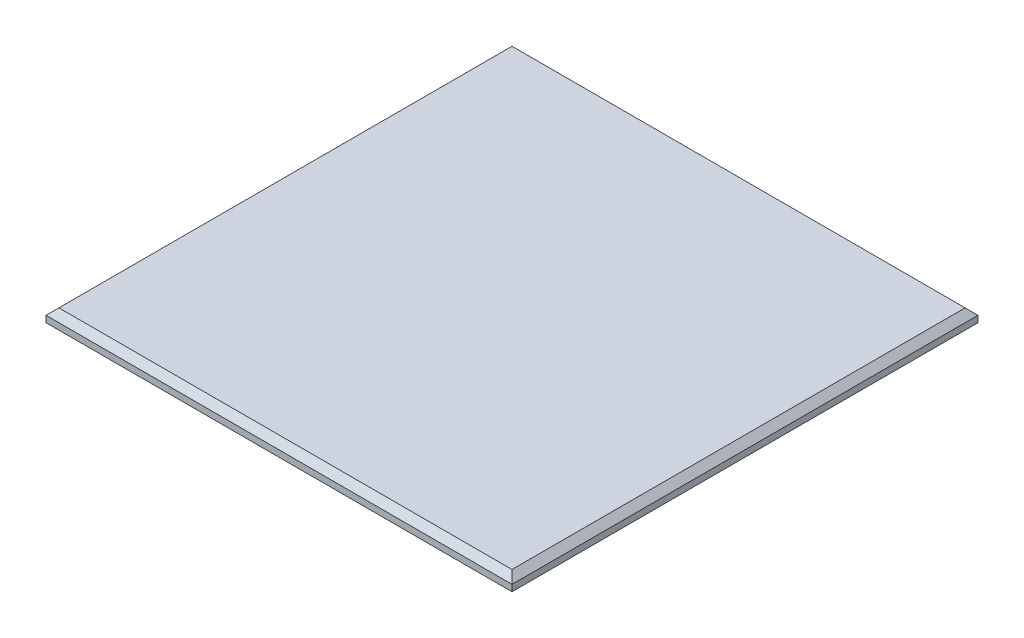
ISO-10303-21;
HEADER;
FILE_DESCRIPTION(('STEP AP214'),'2;1');
FILE_NAME('part.step','',(''),(''),'','','');
FILE_SCHEMA(('AUTOMOTIVE_DESIGN { 1 0 10303 214 1 1 1 1 }'));
ENDSEC;
DATA;
#1=APPLICATION_CONTEXT('core data for automotive mechanical design processes');
#2=APPLICATION_PROTOCOL_DEFINITION('international standard','automotive_design',2000,#1);
#3=PRODUCT_CONTEXT('',#1,'mechanical');
#4=PRODUCT('Part','Part','',(#3));
#5=PRODUCT_RELATED_PRODUCT_CATEGORY('part','',(#4));
#6=PRODUCT_DEFINITION_FORMATION('','',#4);
#7=PRODUCT_DEFINITION_CONTEXT('part definition',#1,'design');
#8=PRODUCT_DEFINITION('design','',#6,#7);
#9=PRODUCT_DEFINITION_SHAPE('','',#8);
#10=(LENGTH_UNIT() NAMED_UNIT(*) SI_UNIT(.MILLI.,.METRE.));
#11=(NAMED_UNIT(*) PLANE_ANGLE_UNIT() SI_UNIT($,.RADIAN.));
#12=(NAMED_UNIT(*) SI_UNIT($,.STERADIAN.) SOLID_ANGLE_UNIT());
#13=UNCERTAINTY_MEASURE_WITH_UNIT(LENGTH_MEASURE(1.E-05),#10,'distance_accuracy_value','');
#14=(GEOMETRIC_REPRESENTATION_CONTEXT(3) GLOBAL_UNCERTAINTY_ASSIGNED_CONTEXT((#13)) GLOBAL_UNIT_ASSIGNED_CONTEXT((#10,
#11,#12)) REPRESENTATION_CONTEXT('',''));
#15=CARTESIAN_POINT('',(0.,0.,0.));
#16=DIRECTION('',(0.,0.,1.));
#17=DIRECTION('',(1.,0.,0.));
#18=AXIS2_PLACEMENT_3D('',#15,#16,#17);
#19=CARTESIAN_POINT('',(-230.,12.7,-230.));
#20=DIRECTION('',(1.,0.,0.));
#21=DIRECTION('',(0.,0.,-1.));
#22=AXIS2_PLACEMENT_3D('',#19,#20,#21);
#23=PLANE('',#22);
#24=DIRECTION('',(0.,-1.,0.));
#25=VECTOR('',#24,1.);
#26=CARTESIAN_POINT('',(-230.,12.7,230.));
#27=LINE('',#26,#25);
#28=CARTESIAN_POINT('',(-230.,6.34999999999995,230.));
#29=VERTEX_POINT('',#28);
#30=CARTESIAN_POINT('',(-230.,0.,230.));
#31=VERTEX_POINT('',#30);
#32=EDGE_CURVE('E87',#29,#31,#27,.T.);
#33=ORIENTED_EDGE('',*,*,#32,.F.);
#34=DIRECTION('',(0.,0.,-1.));
#35=VECTOR('',#34,1.);
#36=CARTESIAN_POINT('',(-230.,6.34999999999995,-230.));
#37=LINE('',#36,#35);
#38=CARTESIAN_POINT('',(-230.,6.34999999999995,-230.));
#39=VERTEX_POINT('',#38);
#40=EDGE_CURVE('E11',#29,#39,#37,.T.);
#41=ORIENTED_EDGE('',*,*,#40,.T.);
#42=DIRECTION('',(0.,-1.,0.));
#43=VECTOR('',#42,1.);
#44=CARTESIAN_POINT('',(-230.,12.7,-230.));
#45=LINE('',#44,#43);
#46=CARTESIAN_POINT('',(-230.,0.,-230.));
#47=VERTEX_POINT('',#46);
#48=EDGE_CURVE('E107',#39,#47,#45,.T.);
#49=ORIENTED_EDGE('',*,*,#48,.T.);
#50=DIRECTION('',(0.,0.,1.));
#51=VECTOR('',#50,1.);
#52=CARTESIAN_POINT('',(-230.,0.,-230.));
#53=LINE('',#52,#51);
#54=EDGE_CURVE('E103',#47,#31,#53,.T.);
#55=ORIENTED_EDGE('',*,*,#54,.T.);
#56=EDGE_LOOP('',(#33,#41,#49,#55));
#57=FACE_BOUND('',#56,.T.);
#58=ADVANCED_FACE('F34',(#57),#23,.F.);
#59=CARTESIAN_POINT('',(-230.,12.7,230.));
#60=DIRECTION('',(0.,0.,-1.));
#61=DIRECTION('',(-1.,0.,0.));
#62=AXIS2_PLACEMENT_3D('',#59,#60,#61);
#63=PLANE('',#62);
#64=DIRECTION('',(0.,-1.,0.));
#65=VECTOR('',#64,1.);
#66=CARTESIAN_POINT('',(230.,12.7,230.));
#67=LINE('',#66,#65);
#68=CARTESIAN_POINT('',(230.,6.34999999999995,230.));
#69=VERTEX_POINT('',#68);
#70=CARTESIAN_POINT('',(230.,0.,230.));
#71=VERTEX_POINT('',#70);
#72=EDGE_CURVE('E97',#69,#71,#67,.T.);
#73=ORIENTED_EDGE('',*,*,#72,.F.);
#74=DIRECTION('',(-1.,0.,0.));
#75=VECTOR('',#74,1.);
#76=CARTESIAN_POINT('',(-230.,6.34999999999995,230.));
#77=LINE('',#76,#75);
#78=EDGE_CURVE('E94',#69,#29,#77,.T.);
#79=ORIENTED_EDGE('',*,*,#78,.T.);
#80=ORIENTED_EDGE('',*,*,#32,.T.);
#81=DIRECTION('',(1.,0.,0.));
#82=VECTOR('',#81,1.);
#83=CARTESIAN_POINT('',(-230.,0.,230.));
#84=LINE('',#83,#82);
#85=EDGE_CURVE('E91',#31,#71,#84,.T.);
#86=ORIENTED_EDGE('',*,*,#85,.T.);
#87=EDGE_LOOP('',(#73,#79,#80,#86));
#88=FACE_BOUND('',#87,.T.);
#89=ADVANCED_FACE('F90',(#88),#63,.F.);
#90=CARTESIAN_POINT('',(230.,12.7,-230.));
#91=DIRECTION('',(-1.,0.,0.));
#92=DIRECTION('',(0.,0.,1.));
#93=AXIS2_PLACEMENT_3D('',#90,#91,#92);
#94=PLANE('',#93);
#95=DIRECTION('',(0.,-1.,0.));
#96=VECTOR('',#95,1.);
#97=CARTESIAN_POINT('',(230.,12.7,-230.));
#98=LINE('',#97,#96);
#99=CARTESIAN_POINT('',(230.,6.34999999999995,-230.));
#100=VERTEX_POINT('',#99);
#101=CARTESIAN_POINT('',(230.,0.,-230.));
#102=VERTEX_POINT('',#101);
#103=EDGE_CURVE('E117',#100,#102,#98,.T.);
#104=ORIENTED_EDGE('',*,*,#103,.F.);
#105=DIRECTION('',(0.,0.,1.));
#106=VECTOR('',#105,1.);
#107=CARTESIAN_POINT('',(230.,6.34999999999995,230.));
#108=LINE('',#107,#106);
#109=EDGE_CURVE('E129',#100,#69,#108,.T.);
#110=ORIENTED_EDGE('',*,*,#109,.T.);
#111=ORIENTED_EDGE('',*,*,#72,.T.);
#112=DIRECTION('',(0.,0.,-1.));
#113=VECTOR('',#112,1.);
#114=CARTESIAN_POINT('',(230.,0.,-230.));
#115=LINE('',#114,#113);
#116=EDGE_CURVE('E105',#71,#102,#115,.T.);
#117=ORIENTED_EDGE('',*,*,#116,.T.);
#118=EDGE_LOOP('',(#104,#110,#111,#117));
#119=FACE_BOUND('',#118,.T.);
#120=ADVANCED_FACE('F165',(#119),#94,.F.);
#121=CARTESIAN_POINT('',(-230.,12.7,-230.));
#122=DIRECTION('',(0.,0.,1.));
#123=DIRECTION('',(1.,0.,0.));
#124=AXIS2_PLACEMENT_3D('',#121,#122,#123);
#125=PLANE('',#124);
#126=ORIENTED_EDGE('',*,*,#48,.F.);
#127=DIRECTION('',(1.,0.,0.));
#128=VECTOR('',#127,1.);
#129=CARTESIAN_POINT('',(230.,6.34999999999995,-230.));
#130=LINE('',#129,#128);
#131=EDGE_CURVE('E43',#39,#100,#130,.T.);
#132=ORIENTED_EDGE('',*,*,#131,.T.);
#133=ORIENTED_EDGE('',*,*,#103,.T.);
#134=DIRECTION('',(-1.,0.,0.));
#135=VECTOR('',#134,1.);
#136=CARTESIAN_POINT('',(-230.,0.,-230.));
#137=LINE('',#136,#135);
#138=EDGE_CURVE('E114',#102,#47,#137,.T.);
#139=ORIENTED_EDGE('',*,*,#138,.T.);
#140=EDGE_LOOP('',(#126,#132,#133,#139));
#141=FACE_BOUND('',#140,.T.);
#142=ADVANCED_FACE('F198',(#141),#125,.F.);
#143=CARTESIAN_POINT('',(-230.,12.7,230.));
#144=DIRECTION('',(0.,1.,0.));
#145=DIRECTION('',(0.,0.,1.));
#146=AXIS2_PLACEMENT_3D('',#143,#144,#145);
#147=PLANE('',#146);
#148=DIRECTION('',(0.,0.,1.));
#149=VECTOR('',#148,1.);
#150=CARTESIAN_POINT('',(-223.65,12.7,230.));
#151=LINE('',#150,#149);
#152=CARTESIAN_POINT('',(-223.65,12.7,-223.65));
#153=VERTEX_POINT('',#152);
#154=CARTESIAN_POINT('',(-223.65,12.7,223.65));
#155=VERTEX_POINT('',#154);
#156=EDGE_CURVE('E96',#153,#155,#151,.T.);
#157=ORIENTED_EDGE('',*,*,#156,.T.);
#158=DIRECTION('',(1.,0.,0.));
#159=VECTOR('',#158,1.);
#160=CARTESIAN_POINT('',(230.,12.7,223.65));
#161=LINE('',#160,#159);
#162=CARTESIAN_POINT('',(223.65,12.7,223.65));
#163=VERTEX_POINT('',#162);
#164=EDGE_CURVE('E125',#155,#163,#161,.T.);
#165=ORIENTED_EDGE('',*,*,#164,.T.);
#166=DIRECTION('',(0.,0.,-1.));
#167=VECTOR('',#166,1.);
#168=CARTESIAN_POINT('',(223.65,12.7,-230.));
#169=LINE('',#168,#167);
#170=CARTESIAN_POINT('',(223.65,12.7,-223.65));
#171=VERTEX_POINT('',#170);
#172=EDGE_CURVE('E123',#163,#171,#169,.T.);
#173=ORIENTED_EDGE('',*,*,#172,.T.);
#174=DIRECTION('',(-1.,0.,0.));
#175=VECTOR('',#174,1.);
#176=CARTESIAN_POINT('',(-230.,12.7,-223.65));
#177=LINE('',#176,#175);
#178=EDGE_CURVE('E121',#171,#153,#177,.T.);
#179=ORIENTED_EDGE('',*,*,#178,.T.);
#180=EDGE_LOOP('',(#157,#165,#173,#179));
#181=FACE_BOUND('',#180,.T.);
#182=ADVANCED_FACE('F147',(#181),#147,.T.);
#183=CARTESIAN_POINT('',(-230.,0.,230.));
#184=DIRECTION('',(0.,1.,0.));
#185=DIRECTION('',(0.,0.,1.));
#186=AXIS2_PLACEMENT_3D('',#183,#184,#185);
#187=PLANE('',#186);
#188=ORIENTED_EDGE('',*,*,#54,.F.);
#189=ORIENTED_EDGE('',*,*,#138,.F.);
#190=ORIENTED_EDGE('',*,*,#116,.F.);
#191=ORIENTED_EDGE('',*,*,#85,.F.);
#192=EDGE_LOOP('',(#188,#189,#190,#191));
#193=FACE_BOUND('',#192,.T.);
#194=ADVANCED_FACE('F101',(#193),#187,.F.);
#195=CARTESIAN_POINT('',(-230.,12.7,-223.65));
#196=DIRECTION('',(0.,0.707106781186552,-0.707106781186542));
#197=DIRECTION('',(0.,0.707106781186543,0.707106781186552));
#198=AXIS2_PLACEMENT_3D('',#195,#196,#197);
#199=PLANE('',#198);
#200=DIRECTION('',(0.577350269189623,-0.577350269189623,-0.577350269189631));
#201=VECTOR('',#200,1.);
#202=CARTESIAN_POINT('',(72.4333333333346,163.916666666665,-72.4333333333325));
#203=LINE('',#202,#201);
#204=EDGE_CURVE('E111',#100,#171,#203,.F.);
#205=ORIENTED_EDGE('',*,*,#204,.F.);
#206=ORIENTED_EDGE('',*,*,#131,.F.);
#207=DIRECTION('',(-0.577350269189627,-0.577350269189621,-0.577350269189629));
#208=VECTOR('',#207,1.);
#209=CARTESIAN_POINT('',(-72.433333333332,163.916666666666,-72.4333333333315));
#210=LINE('',#209,#208);
#211=EDGE_CURVE('E38',#153,#39,#210,.T.);
#212=ORIENTED_EDGE('',*,*,#211,.F.);
#213=ORIENTED_EDGE('',*,*,#178,.F.);
#214=EDGE_LOOP('',(#205,#206,#212,#213));
#215=FACE_BOUND('',#214,.T.);
#216=ADVANCED_FACE('F36',(#215),#199,.T.);
#217=CARTESIAN_POINT('',(-223.65,12.7,230.));
#218=DIRECTION('',(-0.707106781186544,0.707106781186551,0.));
#219=DIRECTION('',(-0.707106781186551,-0.707106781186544,0.));
#220=AXIS2_PLACEMENT_3D('',#217,#218,#219);
#221=PLANE('',#220);
#222=ORIENTED_EDGE('',*,*,#211,.T.);
#223=ORIENTED_EDGE('',*,*,#40,.F.);
#224=DIRECTION('',(0.577350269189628,0.577350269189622,-0.577350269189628));
#225=VECTOR('',#224,1.);
#226=CARTESIAN_POINT('',(-225.766666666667,10.5833333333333,225.766666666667));
#227=LINE('',#226,#225);
#228=EDGE_CURVE('E134',#155,#29,#227,.F.);
#229=ORIENTED_EDGE('',*,*,#228,.F.);
#230=ORIENTED_EDGE('',*,*,#156,.F.);
#231=EDGE_LOOP('',(#222,#223,#229,#230));
#232=FACE_BOUND('',#231,.T.);
#233=ADVANCED_FACE('F153',(#232),#221,.T.);
#234=CARTESIAN_POINT('',(223.65,12.7,230.));
#235=DIRECTION('',(0.707106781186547,0.707106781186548,0.));
#236=DIRECTION('',(-0.707106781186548,0.707106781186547,0.));
#237=AXIS2_PLACEMENT_3D('',#234,#235,#236);
#238=PLANE('',#237);
#239=ORIENTED_EDGE('',*,*,#204,.T.);
#240=ORIENTED_EDGE('',*,*,#172,.F.);
#241=DIRECTION('',(0.577350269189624,-0.577350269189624,0.577350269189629));
#242=VECTOR('',#241,1.);
#243=CARTESIAN_POINT('',(225.766666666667,10.5833333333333,225.766666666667));
#244=LINE('',#243,#242);
#245=EDGE_CURVE('E132',#69,#163,#244,.F.);
#246=ORIENTED_EDGE('',*,*,#245,.F.);
#247=ORIENTED_EDGE('',*,*,#109,.F.);
#248=EDGE_LOOP('',(#239,#240,#246,#247));
#249=FACE_BOUND('',#248,.T.);
#250=ADVANCED_FACE('F140',(#249),#238,.T.);
#251=CARTESIAN_POINT('',(-230.,12.7,223.65));
#252=DIRECTION('',(0.,0.707106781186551,0.707106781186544));
#253=DIRECTION('',(0.,-0.707106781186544,0.707106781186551));
#254=AXIS2_PLACEMENT_3D('',#251,#252,#253);
#255=PLANE('',#254);
#256=ORIENTED_EDGE('',*,*,#228,.T.);
#257=ORIENTED_EDGE('',*,*,#78,.F.);
#258=ORIENTED_EDGE('',*,*,#245,.T.);
#259=ORIENTED_EDGE('',*,*,#164,.F.);
#260=EDGE_LOOP('',(#256,#257,#258,#259));
#261=FACE_BOUND('',#260,.T.);
#262=ADVANCED_FACE('F151',(#261),#255,.T.);
#263=CLOSED_SHELL('',(#58,#89,#120,#142,#182,#194,#216,#233,#250,#262));
#264=MANIFOLD_SOLID_BREP('B2',#263);
#265=ADVANCED_BREP_SHAPE_REPRESENTATION('',(#18,#264),#14);
#266=SHAPE_DEFINITION_REPRESENTATION(#9,#265);
ENDSEC;
END-ISO-10303-21;
